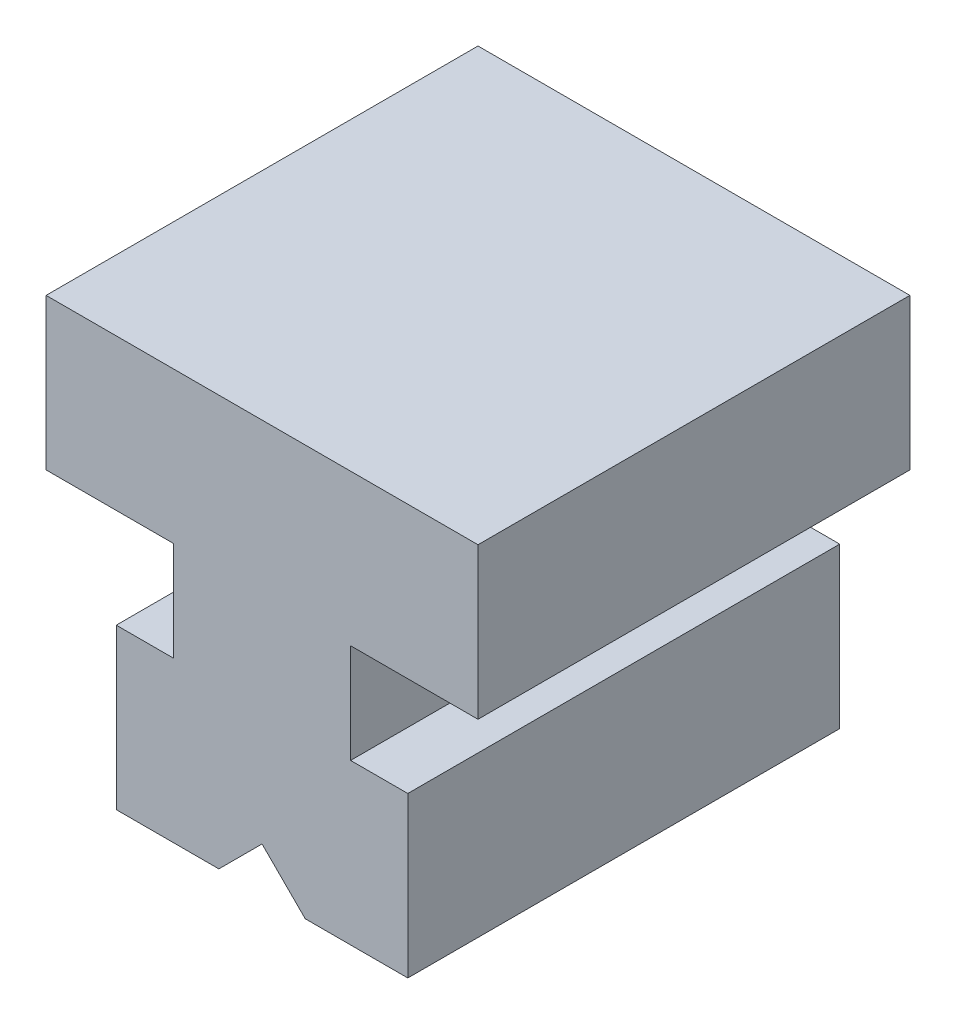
ISO-10303-21;
HEADER;
FILE_DESCRIPTION(('STEP AP214'),'2;1');
FILE_NAME('part.step','',(''),(''),'','','');
FILE_SCHEMA(('AUTOMOTIVE_DESIGN { 1 0 10303 214 1 1 1 1 }'));
ENDSEC;
DATA;
#1=APPLICATION_CONTEXT('core data for automotive mechanical design processes');
#2=APPLICATION_PROTOCOL_DEFINITION('international standard','automotive_design',2000,#1);
#3=PRODUCT_CONTEXT('',#1,'mechanical');
#4=PRODUCT('Part','Part','',(#3));
#5=PRODUCT_RELATED_PRODUCT_CATEGORY('part','',(#4));
#6=PRODUCT_DEFINITION_FORMATION('','',#4);
#7=PRODUCT_DEFINITION_CONTEXT('part definition',#1,'design');
#8=PRODUCT_DEFINITION('design','',#6,#7);
#9=PRODUCT_DEFINITION_SHAPE('','',#8);
#10=(LENGTH_UNIT() NAMED_UNIT(*) SI_UNIT(.MILLI.,.METRE.));
#11=(NAMED_UNIT(*) PLANE_ANGLE_UNIT() SI_UNIT($,.RADIAN.));
#12=(NAMED_UNIT(*) SI_UNIT($,.STERADIAN.) SOLID_ANGLE_UNIT());
#13=UNCERTAINTY_MEASURE_WITH_UNIT(LENGTH_MEASURE(1.E-05),#10,'distance_accuracy_value','');
#14=(GEOMETRIC_REPRESENTATION_CONTEXT(3) GLOBAL_UNCERTAINTY_ASSIGNED_CONTEXT((#13)) GLOBAL_UNIT_ASSIGNED_CONTEXT((#10,
#11,#12)) REPRESENTATION_CONTEXT('',''));
#15=CARTESIAN_POINT('',(0.,0.,0.));
#16=DIRECTION('',(0.,0.,1.));
#17=DIRECTION('',(1.,0.,0.));
#18=AXIS2_PLACEMENT_3D('',#15,#16,#17);
#19=CARTESIAN_POINT('',(-6.75,-4.6,0.));
#20=DIRECTION('',(0.,1.,0.));
#21=DIRECTION('',(0.,0.,1.));
#22=AXIS2_PLACEMENT_3D('',#19,#20,#21);
#23=PLANE('',#22);
#24=DIRECTION('',(1.,0.,0.));
#25=VECTOR('',#24,1.);
#26=CARTESIAN_POINT('',(0.,-4.6,-10.));
#27=LINE('',#26,#25);
#28=CARTESIAN_POINT('',(-4.1,-4.6,-10.));
#29=VERTEX_POINT('',#28);
#30=CARTESIAN_POINT('',(-6.75,-4.6,-10.));
#31=VERTEX_POINT('',#30);
#32=EDGE_CURVE('E184',#29,#31,#27,.F.);
#33=ORIENTED_EDGE('',*,*,#32,.T.);
#34=DIRECTION('',(0.,0.,1.));
#35=VECTOR('',#34,1.);
#36=CARTESIAN_POINT('',(-6.75,-4.6,0.));
#37=LINE('',#36,#35);
#38=CARTESIAN_POINT('',(-6.75,-4.6,10.));
#39=VERTEX_POINT('',#38);
#40=EDGE_CURVE('E18',#39,#31,#37,.F.);
#41=ORIENTED_EDGE('',*,*,#40,.F.);
#42=DIRECTION('',(1.,0.,0.));
#43=VECTOR('',#42,1.);
#44=CARTESIAN_POINT('',(0.,-4.6,10.));
#45=LINE('',#44,#43);
#46=CARTESIAN_POINT('',(-4.1,-4.6,10.));
#47=VERTEX_POINT('',#46);
#48=EDGE_CURVE('E138',#47,#39,#45,.F.);
#49=ORIENTED_EDGE('',*,*,#48,.F.);
#50=DIRECTION('',(0.,0.,1.));
#51=VECTOR('',#50,1.);
#52=CARTESIAN_POINT('',(-4.1,-4.6,0.));
#53=LINE('',#52,#51);
#54=EDGE_CURVE('E119',#29,#47,#53,.T.);
#55=ORIENTED_EDGE('',*,*,#54,.F.);
#56=EDGE_LOOP('',(#33,#41,#49,#55));
#57=FACE_BOUND('',#56,.T.);
#58=ADVANCED_FACE('F15',(#57),#23,.T.);
#59=CARTESIAN_POINT('',(-6.75,-12.,0.));
#60=DIRECTION('',(-1.,0.,0.));
#61=DIRECTION('',(0.,0.,1.));
#62=AXIS2_PLACEMENT_3D('',#59,#60,#61);
#63=PLANE('',#62);
#64=DIRECTION('',(0.,1.,0.));
#65=VECTOR('',#64,1.);
#66=CARTESIAN_POINT('',(-6.75,-1.72402858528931,-10.));
#67=LINE('',#66,#65);
#68=CARTESIAN_POINT('',(-6.75,-12.,-10.));
#69=VERTEX_POINT('',#68);
#70=EDGE_CURVE('E178',#31,#69,#67,.F.);
#71=ORIENTED_EDGE('',*,*,#70,.T.);
#72=DIRECTION('',(0.,0.,-1.));
#73=VECTOR('',#72,1.);
#74=CARTESIAN_POINT('',(-6.75,-12.,0.));
#75=LINE('',#74,#73);
#76=CARTESIAN_POINT('',(-6.75,-12.,10.));
#77=VERTEX_POINT('',#76);
#78=EDGE_CURVE('E168',#77,#69,#75,.T.);
#79=ORIENTED_EDGE('',*,*,#78,.F.);
#80=DIRECTION('',(0.,1.,0.));
#81=VECTOR('',#80,1.);
#82=CARTESIAN_POINT('',(-6.75,-1.72402858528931,10.));
#83=LINE('',#82,#81);
#84=EDGE_CURVE('E180',#39,#77,#83,.F.);
#85=ORIENTED_EDGE('',*,*,#84,.F.);
#86=ORIENTED_EDGE('',*,*,#40,.T.);
#87=EDGE_LOOP('',(#71,#79,#85,#86));
#88=FACE_BOUND('',#87,.T.);
#89=ADVANCED_FACE('F177',(#88),#63,.T.);
#90=CARTESIAN_POINT('',(-2.,-12.,0.));
#91=DIRECTION('',(0.,-1.,0.));
#92=DIRECTION('',(0.,0.,-1.));
#93=AXIS2_PLACEMENT_3D('',#90,#91,#92);
#94=PLANE('',#93);
#95=DIRECTION('',(1.,0.,0.));
#96=VECTOR('',#95,1.);
#97=CARTESIAN_POINT('',(0.,-12.,-10.));
#98=LINE('',#97,#96);
#99=CARTESIAN_POINT('',(-2.,-12.,-10.));
#100=VERTEX_POINT('',#99);
#101=EDGE_CURVE('E186',#69,#100,#98,.T.);
#102=ORIENTED_EDGE('',*,*,#101,.T.);
#103=DIRECTION('',(0.,0.,1.));
#104=VECTOR('',#103,1.);
#105=CARTESIAN_POINT('',(-2.,-12.,0.));
#106=LINE('',#105,#104);
#107=CARTESIAN_POINT('',(-2.,-12.,10.));
#108=VERTEX_POINT('',#107);
#109=EDGE_CURVE('E166',#108,#100,#106,.F.);
#110=ORIENTED_EDGE('',*,*,#109,.F.);
#111=DIRECTION('',(1.,0.,0.));
#112=VECTOR('',#111,1.);
#113=CARTESIAN_POINT('',(0.,-12.,10.));
#114=LINE('',#113,#112);
#115=EDGE_CURVE('E219',#77,#108,#114,.T.);
#116=ORIENTED_EDGE('',*,*,#115,.F.);
#117=ORIENTED_EDGE('',*,*,#78,.T.);
#118=EDGE_LOOP('',(#102,#110,#116,#117));
#119=FACE_BOUND('',#118,.T.);
#120=ADVANCED_FACE('F258',(#119),#94,.T.);
#121=CARTESIAN_POINT('',(0.,-10.,0.));
#122=DIRECTION('',(0.707106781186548,-0.707106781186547,0.));
#123=DIRECTION('',(0.707106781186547,0.707106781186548,0.));
#124=AXIS2_PLACEMENT_3D('',#121,#122,#123);
#125=PLANE('',#124);
#126=DIRECTION('',(0.707106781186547,0.707106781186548,0.));
#127=VECTOR('',#126,1.);
#128=CARTESIAN_POINT('',(-2.,-12.,-10.));
#129=LINE('',#128,#127);
#130=CARTESIAN_POINT('',(0.,-10.,-10.));
#131=VERTEX_POINT('',#130);
#132=EDGE_CURVE('E188',#100,#131,#129,.T.);
#133=ORIENTED_EDGE('',*,*,#132,.T.);
#134=DIRECTION('',(0.,0.,1.));
#135=VECTOR('',#134,1.);
#136=CARTESIAN_POINT('',(0.,-10.,0.));
#137=LINE('',#136,#135);
#138=CARTESIAN_POINT('',(0.,-10.,10.));
#139=VERTEX_POINT('',#138);
#140=EDGE_CURVE('E163',#139,#131,#137,.F.);
#141=ORIENTED_EDGE('',*,*,#140,.F.);
#142=DIRECTION('',(0.707106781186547,0.707106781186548,0.));
#143=VECTOR('',#142,1.);
#144=CARTESIAN_POINT('',(-2.,-12.,10.));
#145=LINE('',#144,#143);
#146=EDGE_CURVE('E216',#108,#139,#145,.T.);
#147=ORIENTED_EDGE('',*,*,#146,.F.);
#148=ORIENTED_EDGE('',*,*,#109,.T.);
#149=EDGE_LOOP('',(#133,#141,#147,#148));
#150=FACE_BOUND('',#149,.T.);
#151=ADVANCED_FACE('F242',(#150),#125,.T.);
#152=CARTESIAN_POINT('',(2.,-12.,0.));
#153=DIRECTION('',(-0.707106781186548,-0.707106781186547,0.));
#154=DIRECTION('',(0.707106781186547,-0.707106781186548,0.));
#155=AXIS2_PLACEMENT_3D('',#152,#153,#154);
#156=PLANE('',#155);
#157=DIRECTION('',(0.707106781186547,-0.707106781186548,0.));
#158=VECTOR('',#157,1.);
#159=CARTESIAN_POINT('',(0.,-10.,-10.));
#160=LINE('',#159,#158);
#161=CARTESIAN_POINT('',(2.,-12.,-10.));
#162=VERTEX_POINT('',#161);
#163=EDGE_CURVE('E240',#131,#162,#160,.T.);
#164=ORIENTED_EDGE('',*,*,#163,.T.);
#165=DIRECTION('',(0.,0.,-1.));
#166=VECTOR('',#165,1.);
#167=CARTESIAN_POINT('',(2.,-12.,0.));
#168=LINE('',#167,#166);
#169=CARTESIAN_POINT('',(2.,-12.,10.));
#170=VERTEX_POINT('',#169);
#171=EDGE_CURVE('E160',#170,#162,#168,.T.);
#172=ORIENTED_EDGE('',*,*,#171,.F.);
#173=DIRECTION('',(0.707106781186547,-0.707106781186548,0.));
#174=VECTOR('',#173,1.);
#175=CARTESIAN_POINT('',(0.,-10.,10.));
#176=LINE('',#175,#174);
#177=EDGE_CURVE('E213',#139,#170,#176,.T.);
#178=ORIENTED_EDGE('',*,*,#177,.F.);
#179=ORIENTED_EDGE('',*,*,#140,.T.);
#180=EDGE_LOOP('',(#164,#172,#178,#179));
#181=FACE_BOUND('',#180,.T.);
#182=ADVANCED_FACE('F247',(#181),#156,.T.);
#183=CARTESIAN_POINT('',(6.75,-12.,0.));
#184=DIRECTION('',(0.,-1.,0.));
#185=DIRECTION('',(0.,0.,-1.));
#186=AXIS2_PLACEMENT_3D('',#183,#184,#185);
#187=PLANE('',#186);
#188=DIRECTION('',(1.,0.,0.));
#189=VECTOR('',#188,1.);
#190=CARTESIAN_POINT('',(0.,-12.,-10.));
#191=LINE('',#190,#189);
#192=CARTESIAN_POINT('',(6.75,-12.,-10.));
#193=VERTEX_POINT('',#192);
#194=EDGE_CURVE('E238',#162,#193,#191,.T.);
#195=ORIENTED_EDGE('',*,*,#194,.T.);
#196=DIRECTION('',(0.,0.,-1.));
#197=VECTOR('',#196,1.);
#198=CARTESIAN_POINT('',(6.75,-12.,0.));
#199=LINE('',#198,#197);
#200=CARTESIAN_POINT('',(6.75,-12.,10.));
#201=VERTEX_POINT('',#200);
#202=EDGE_CURVE('E157',#201,#193,#199,.T.);
#203=ORIENTED_EDGE('',*,*,#202,.F.);
#204=DIRECTION('',(1.,0.,0.));
#205=VECTOR('',#204,1.);
#206=CARTESIAN_POINT('',(0.,-12.,10.));
#207=LINE('',#206,#205);
#208=EDGE_CURVE('E210',#170,#201,#207,.T.);
#209=ORIENTED_EDGE('',*,*,#208,.F.);
#210=ORIENTED_EDGE('',*,*,#171,.T.);
#211=EDGE_LOOP('',(#195,#203,#209,#210));
#212=FACE_BOUND('',#211,.T.);
#213=ADVANCED_FACE('F252',(#212),#187,.T.);
#214=CARTESIAN_POINT('',(6.75,-4.6,0.));
#215=DIRECTION('',(1.,0.,0.));
#216=DIRECTION('',(0.,0.,-1.));
#217=AXIS2_PLACEMENT_3D('',#214,#215,#216);
#218=PLANE('',#217);
#219=DIRECTION('',(0.,1.,0.));
#220=VECTOR('',#219,1.);
#221=CARTESIAN_POINT('',(6.75,-1.72402858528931,-10.));
#222=LINE('',#221,#220);
#223=CARTESIAN_POINT('',(6.75,-4.6,-10.));
#224=VERTEX_POINT('',#223);
#225=EDGE_CURVE('E236',#193,#224,#222,.T.);
#226=ORIENTED_EDGE('',*,*,#225,.T.);
#227=DIRECTION('',(0.,0.,1.));
#228=VECTOR('',#227,1.);
#229=CARTESIAN_POINT('',(6.75,-4.6,0.));
#230=LINE('',#229,#228);
#231=CARTESIAN_POINT('',(6.75,-4.6,10.));
#232=VERTEX_POINT('',#231);
#233=EDGE_CURVE('E154',#232,#224,#230,.F.);
#234=ORIENTED_EDGE('',*,*,#233,.F.);
#235=DIRECTION('',(0.,1.,0.));
#236=VECTOR('',#235,1.);
#237=CARTESIAN_POINT('',(6.75,-1.72402858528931,10.));
#238=LINE('',#237,#236);
#239=EDGE_CURVE('E207',#201,#232,#238,.T.);
#240=ORIENTED_EDGE('',*,*,#239,.F.);
#241=ORIENTED_EDGE('',*,*,#202,.T.);
#242=EDGE_LOOP('',(#226,#234,#240,#241));
#243=FACE_BOUND('',#242,.T.);
#244=ADVANCED_FACE('F256',(#243),#218,.T.);
#245=CARTESIAN_POINT('',(4.1,-4.6,0.));
#246=DIRECTION('',(0.,1.,0.));
#247=DIRECTION('',(0.,0.,1.));
#248=AXIS2_PLACEMENT_3D('',#245,#246,#247);
#249=PLANE('',#248);
#250=DIRECTION('',(1.,0.,0.));
#251=VECTOR('',#250,1.);
#252=CARTESIAN_POINT('',(0.,-4.6,-10.));
#253=LINE('',#252,#251);
#254=CARTESIAN_POINT('',(4.1,-4.6,-10.));
#255=VERTEX_POINT('',#254);
#256=EDGE_CURVE('E234',#224,#255,#253,.F.);
#257=ORIENTED_EDGE('',*,*,#256,.T.);
#258=DIRECTION('',(0.,0.,-1.));
#259=VECTOR('',#258,1.);
#260=CARTESIAN_POINT('',(4.1,-4.6,0.));
#261=LINE('',#260,#259);
#262=CARTESIAN_POINT('',(4.1,-4.6,10.));
#263=VERTEX_POINT('',#262);
#264=EDGE_CURVE('E151',#263,#255,#261,.T.);
#265=ORIENTED_EDGE('',*,*,#264,.F.);
#266=DIRECTION('',(1.,0.,0.));
#267=VECTOR('',#266,1.);
#268=CARTESIAN_POINT('',(0.,-4.6,10.));
#269=LINE('',#268,#267);
#270=EDGE_CURVE('E204',#232,#263,#269,.F.);
#271=ORIENTED_EDGE('',*,*,#270,.F.);
#272=ORIENTED_EDGE('',*,*,#233,.T.);
#273=EDGE_LOOP('',(#257,#265,#271,#272));
#274=FACE_BOUND('',#273,.T.);
#275=ADVANCED_FACE('F298',(#274),#249,.T.);
#276=CARTESIAN_POINT('',(4.1,0.,0.));
#277=DIRECTION('',(1.,0.,0.));
#278=DIRECTION('',(0.,0.,-1.));
#279=AXIS2_PLACEMENT_3D('',#276,#277,#278);
#280=PLANE('',#279);
#281=DIRECTION('',(0.,1.,0.));
#282=VECTOR('',#281,1.);
#283=CARTESIAN_POINT('',(4.1,-1.72402858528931,-10.));
#284=LINE('',#283,#282);
#285=CARTESIAN_POINT('',(4.1,0.,-10.));
#286=VERTEX_POINT('',#285);
#287=EDGE_CURVE('E232',#255,#286,#284,.T.);
#288=ORIENTED_EDGE('',*,*,#287,.T.);
#289=DIRECTION('',(0.,0.,-1.));
#290=VECTOR('',#289,1.);
#291=CARTESIAN_POINT('',(4.1,0.,0.));
#292=LINE('',#291,#290);
#293=CARTESIAN_POINT('',(4.1,0.,10.));
#294=VERTEX_POINT('',#293);
#295=EDGE_CURVE('E148',#294,#286,#292,.T.);
#296=ORIENTED_EDGE('',*,*,#295,.F.);
#297=DIRECTION('',(0.,1.,0.));
#298=VECTOR('',#297,1.);
#299=CARTESIAN_POINT('',(4.1,-1.72402858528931,10.));
#300=LINE('',#299,#298);
#301=EDGE_CURVE('E201',#263,#294,#300,.T.);
#302=ORIENTED_EDGE('',*,*,#301,.F.);
#303=ORIENTED_EDGE('',*,*,#264,.T.);
#304=EDGE_LOOP('',(#288,#296,#302,#303));
#305=FACE_BOUND('',#304,.T.);
#306=ADVANCED_FACE('F294',(#305),#280,.T.);
#307=CARTESIAN_POINT('',(10.,0.,0.));
#308=DIRECTION('',(0.,-1.,0.));
#309=DIRECTION('',(0.,0.,-1.));
#310=AXIS2_PLACEMENT_3D('',#307,#308,#309);
#311=PLANE('',#310);
#312=DIRECTION('',(1.,0.,0.));
#313=VECTOR('',#312,1.);
#314=CARTESIAN_POINT('',(0.,0.,-10.));
#315=LINE('',#314,#313);
#316=CARTESIAN_POINT('',(10.,0.,-10.));
#317=VERTEX_POINT('',#316);
#318=EDGE_CURVE('E230',#286,#317,#315,.T.);
#319=ORIENTED_EDGE('',*,*,#318,.T.);
#320=DIRECTION('',(0.,0.,-1.));
#321=VECTOR('',#320,1.);
#322=CARTESIAN_POINT('',(10.,0.,0.));
#323=LINE('',#322,#321);
#324=CARTESIAN_POINT('',(10.,0.,10.));
#325=VERTEX_POINT('',#324);
#326=EDGE_CURVE('E190',#325,#317,#323,.T.);
#327=ORIENTED_EDGE('',*,*,#326,.F.);
#328=DIRECTION('',(1.,0.,0.));
#329=VECTOR('',#328,1.);
#330=CARTESIAN_POINT('',(0.,0.,10.));
#331=LINE('',#330,#329);
#332=EDGE_CURVE('E199',#294,#325,#331,.T.);
#333=ORIENTED_EDGE('',*,*,#332,.F.);
#334=ORIENTED_EDGE('',*,*,#295,.T.);
#335=EDGE_LOOP('',(#319,#327,#333,#334));
#336=FACE_BOUND('',#335,.T.);
#337=ADVANCED_FACE('F291',(#336),#311,.T.);
#338=CARTESIAN_POINT('',(-4.1,-4.6,0.));
#339=DIRECTION('',(-1.,0.,0.));
#340=DIRECTION('',(0.,0.,1.));
#341=AXIS2_PLACEMENT_3D('',#338,#339,#340);
#342=PLANE('',#341);
#343=DIRECTION('',(0.,1.,0.));
#344=VECTOR('',#343,1.);
#345=CARTESIAN_POINT('',(-4.1,-1.72402858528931,-10.));
#346=LINE('',#345,#344);
#347=CARTESIAN_POINT('',(-4.1,0.,-10.));
#348=VERTEX_POINT('',#347);
#349=EDGE_CURVE('E222',#348,#29,#346,.F.);
#350=ORIENTED_EDGE('',*,*,#349,.T.);
#351=ORIENTED_EDGE('',*,*,#54,.T.);
#352=DIRECTION('',(0.,1.,0.));
#353=VECTOR('',#352,1.);
#354=CARTESIAN_POINT('',(-4.1,-1.72402858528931,10.));
#355=LINE('',#354,#353);
#356=CARTESIAN_POINT('',(-4.1,0.,10.));
#357=VERTEX_POINT('',#356);
#358=EDGE_CURVE('E134',#357,#47,#355,.F.);
#359=ORIENTED_EDGE('',*,*,#358,.F.);
#360=DIRECTION('',(0.,0.,-1.));
#361=VECTOR('',#360,1.);
#362=CARTESIAN_POINT('',(-4.1,0.,0.));
#363=LINE('',#362,#361);
#364=EDGE_CURVE('E124',#348,#357,#363,.F.);
#365=ORIENTED_EDGE('',*,*,#364,.F.);
#366=EDGE_LOOP('',(#350,#351,#359,#365));
#367=FACE_BOUND('',#366,.T.);
#368=ADVANCED_FACE('F135',(#367),#342,.T.);
#369=CARTESIAN_POINT('',(-4.1,0.,0.));
#370=DIRECTION('',(0.,-1.,0.));
#371=DIRECTION('',(0.,0.,-1.));
#372=AXIS2_PLACEMENT_3D('',#369,#370,#371);
#373=PLANE('',#372);
#374=DIRECTION('',(1.,0.,0.));
#375=VECTOR('',#374,1.);
#376=CARTESIAN_POINT('',(0.,0.,-10.));
#377=LINE('',#376,#375);
#378=CARTESIAN_POINT('',(-10.,0.,-10.));
#379=VERTEX_POINT('',#378);
#380=EDGE_CURVE('E130',#379,#348,#377,.T.);
#381=ORIENTED_EDGE('',*,*,#380,.T.);
#382=ORIENTED_EDGE('',*,*,#364,.T.);
#383=DIRECTION('',(1.,0.,0.));
#384=VECTOR('',#383,1.);
#385=CARTESIAN_POINT('',(0.,0.,10.));
#386=LINE('',#385,#384);
#387=CARTESIAN_POINT('',(-10.,0.,10.));
#388=VERTEX_POINT('',#387);
#389=EDGE_CURVE('E128',#388,#357,#386,.T.);
#390=ORIENTED_EDGE('',*,*,#389,.F.);
#391=DIRECTION('',(0.,0.,1.));
#392=VECTOR('',#391,1.);
#393=CARTESIAN_POINT('',(-10.,0.,0.));
#394=LINE('',#393,#392);
#395=EDGE_CURVE('E389',#379,#388,#394,.T.);
#396=ORIENTED_EDGE('',*,*,#395,.F.);
#397=EDGE_LOOP('',(#381,#382,#390,#396));
#398=FACE_BOUND('',#397,.T.);
#399=ADVANCED_FACE('F125',(#398),#373,.T.);
#400=CARTESIAN_POINT('',(0.,-1.72402858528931,10.));
#401=DIRECTION('',(0.,0.,1.));
#402=DIRECTION('',(1.,0.,0.));
#403=AXIS2_PLACEMENT_3D('',#400,#401,#402);
#404=PLANE('',#403);
#405=DIRECTION('',(0.,1.,0.));
#406=VECTOR('',#405,1.);
#407=CARTESIAN_POINT('',(10.,7.,10.));
#408=LINE('',#407,#406);
#409=CARTESIAN_POINT('',(10.,7.,10.));
#410=VERTEX_POINT('',#409);
#411=EDGE_CURVE('E196',#410,#325,#408,.F.);
#412=ORIENTED_EDGE('',*,*,#411,.F.);
#413=DIRECTION('',(1.,0.,0.));
#414=VECTOR('',#413,1.);
#415=CARTESIAN_POINT('',(-10.,7.,10.));
#416=LINE('',#415,#414);
#417=CARTESIAN_POINT('',(-10.,7.,10.));
#418=VERTEX_POINT('',#417);
#419=EDGE_CURVE('E388',#418,#410,#416,.T.);
#420=ORIENTED_EDGE('',*,*,#419,.F.);
#421=DIRECTION('',(0.,1.,0.));
#422=VECTOR('',#421,1.);
#423=CARTESIAN_POINT('',(-10.,0.,10.));
#424=LINE('',#423,#422);
#425=EDGE_CURVE('E142',#388,#418,#424,.T.);
#426=ORIENTED_EDGE('',*,*,#425,.F.);
#427=ORIENTED_EDGE('',*,*,#389,.T.);
#428=ORIENTED_EDGE('',*,*,#358,.T.);
#429=ORIENTED_EDGE('',*,*,#48,.T.);
#430=ORIENTED_EDGE('',*,*,#84,.T.);
#431=ORIENTED_EDGE('',*,*,#115,.T.);
#432=ORIENTED_EDGE('',*,*,#146,.T.);
#433=ORIENTED_EDGE('',*,*,#177,.T.);
#434=ORIENTED_EDGE('',*,*,#208,.T.);
#435=ORIENTED_EDGE('',*,*,#239,.T.);
#436=ORIENTED_EDGE('',*,*,#270,.T.);
#437=ORIENTED_EDGE('',*,*,#301,.T.);
#438=ORIENTED_EDGE('',*,*,#332,.T.);
#439=EDGE_LOOP('',(#412,#420,#426,#427,#428,#429,#430,#431,#432,#433,#434,#435,#436,#437,#438));
#440=FACE_BOUND('',#439,.T.);
#441=ADVANCED_FACE('F140',(#440),#404,.T.);
#442=CARTESIAN_POINT('',(10.,7.,0.));
#443=DIRECTION('',(1.,0.,0.));
#444=DIRECTION('',(0.,0.,-1.));
#445=AXIS2_PLACEMENT_3D('',#442,#443,#444);
#446=PLANE('',#445);
#447=DIRECTION('',(0.,1.,0.));
#448=VECTOR('',#447,1.);
#449=CARTESIAN_POINT('',(10.,-1.72402858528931,-10.));
#450=LINE('',#449,#448);
#451=CARTESIAN_POINT('',(10.,7.,-10.));
#452=VERTEX_POINT('',#451);
#453=EDGE_CURVE('E225',#317,#452,#450,.T.);
#454=ORIENTED_EDGE('',*,*,#453,.T.);
#455=DIRECTION('',(0.,0.,1.));
#456=VECTOR('',#455,1.);
#457=CARTESIAN_POINT('',(10.,7.,0.));
#458=LINE('',#457,#456);
#459=EDGE_CURVE('E386',#410,#452,#458,.F.);
#460=ORIENTED_EDGE('',*,*,#459,.F.);
#461=ORIENTED_EDGE('',*,*,#411,.T.);
#462=ORIENTED_EDGE('',*,*,#326,.T.);
#463=EDGE_LOOP('',(#454,#460,#461,#462));
#464=FACE_BOUND('',#463,.T.);
#465=ADVANCED_FACE('F281',(#464),#446,.T.);
#466=CARTESIAN_POINT('',(0.,-1.72402858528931,-10.));
#467=DIRECTION('',(0.,0.,1.));
#468=DIRECTION('',(1.,0.,0.));
#469=AXIS2_PLACEMENT_3D('',#466,#467,#468);
#470=PLANE('',#469);
#471=ORIENTED_EDGE('',*,*,#380,.F.);
#472=DIRECTION('',(0.,1.,0.));
#473=VECTOR('',#472,1.);
#474=CARTESIAN_POINT('',(-10.,0.,-10.));
#475=LINE('',#474,#473);
#476=CARTESIAN_POINT('',(-10.,7.,-10.));
#477=VERTEX_POINT('',#476);
#478=EDGE_CURVE('E33',#477,#379,#475,.F.);
#479=ORIENTED_EDGE('',*,*,#478,.F.);
#480=DIRECTION('',(1.,0.,0.));
#481=VECTOR('',#480,1.);
#482=CARTESIAN_POINT('',(-10.,7.,-10.));
#483=LINE('',#482,#481);
#484=EDGE_CURVE('E24',#452,#477,#483,.F.);
#485=ORIENTED_EDGE('',*,*,#484,.F.);
#486=ORIENTED_EDGE('',*,*,#453,.F.);
#487=ORIENTED_EDGE('',*,*,#318,.F.);
#488=ORIENTED_EDGE('',*,*,#287,.F.);
#489=ORIENTED_EDGE('',*,*,#256,.F.);
#490=ORIENTED_EDGE('',*,*,#225,.F.);
#491=ORIENTED_EDGE('',*,*,#194,.F.);
#492=ORIENTED_EDGE('',*,*,#163,.F.);
#493=ORIENTED_EDGE('',*,*,#132,.F.);
#494=ORIENTED_EDGE('',*,*,#101,.F.);
#495=ORIENTED_EDGE('',*,*,#70,.F.);
#496=ORIENTED_EDGE('',*,*,#32,.F.);
#497=ORIENTED_EDGE('',*,*,#349,.F.);
#498=EDGE_LOOP('',(#471,#479,#485,#486,#487,#488,#489,#490,#491,#492,#493,#494,#495,#496,#497));
#499=FACE_BOUND('',#498,.T.);
#500=ADVANCED_FACE('F183',(#499),#470,.F.);
#501=CARTESIAN_POINT('',(-10.,0.,0.));
#502=DIRECTION('',(-1.,0.,0.));
#503=DIRECTION('',(0.,0.,1.));
#504=AXIS2_PLACEMENT_3D('',#501,#502,#503);
#505=PLANE('',#504);
#506=ORIENTED_EDGE('',*,*,#478,.T.);
#507=ORIENTED_EDGE('',*,*,#395,.T.);
#508=ORIENTED_EDGE('',*,*,#425,.T.);
#509=DIRECTION('',(0.,0.,1.));
#510=VECTOR('',#509,1.);
#511=CARTESIAN_POINT('',(-10.,7.,0.));
#512=LINE('',#511,#510);
#513=EDGE_CURVE('E10',#477,#418,#512,.T.);
#514=ORIENTED_EDGE('',*,*,#513,.F.);
#515=EDGE_LOOP('',(#506,#507,#508,#514));
#516=FACE_BOUND('',#515,.T.);
#517=ADVANCED_FACE('F269',(#516),#505,.T.);
#518=CARTESIAN_POINT('',(-10.,7.,0.));
#519=DIRECTION('',(0.,1.,0.));
#520=DIRECTION('',(0.,0.,1.));
#521=AXIS2_PLACEMENT_3D('',#518,#519,#520);
#522=PLANE('',#521);
#523=ORIENTED_EDGE('',*,*,#484,.T.);
#524=ORIENTED_EDGE('',*,*,#513,.T.);
#525=ORIENTED_EDGE('',*,*,#419,.T.);
#526=ORIENTED_EDGE('',*,*,#459,.T.);
#527=EDGE_LOOP('',(#523,#524,#525,#526));
#528=FACE_BOUND('',#527,.T.);
#529=ADVANCED_FACE('F267',(#528),#522,.T.);
#530=CLOSED_SHELL('',(#58,#89,#120,#151,#182,#213,#244,#275,#306,#337,#368,#399,#441,#465,#500,
#517,#529));
#531=MANIFOLD_SOLID_BREP('B1',#530);
#532=ADVANCED_BREP_SHAPE_REPRESENTATION('',(#18,#531),#14);
#533=SHAPE_DEFINITION_REPRESENTATION(#9,#532);
ENDSEC;
END-ISO-10303-21;
